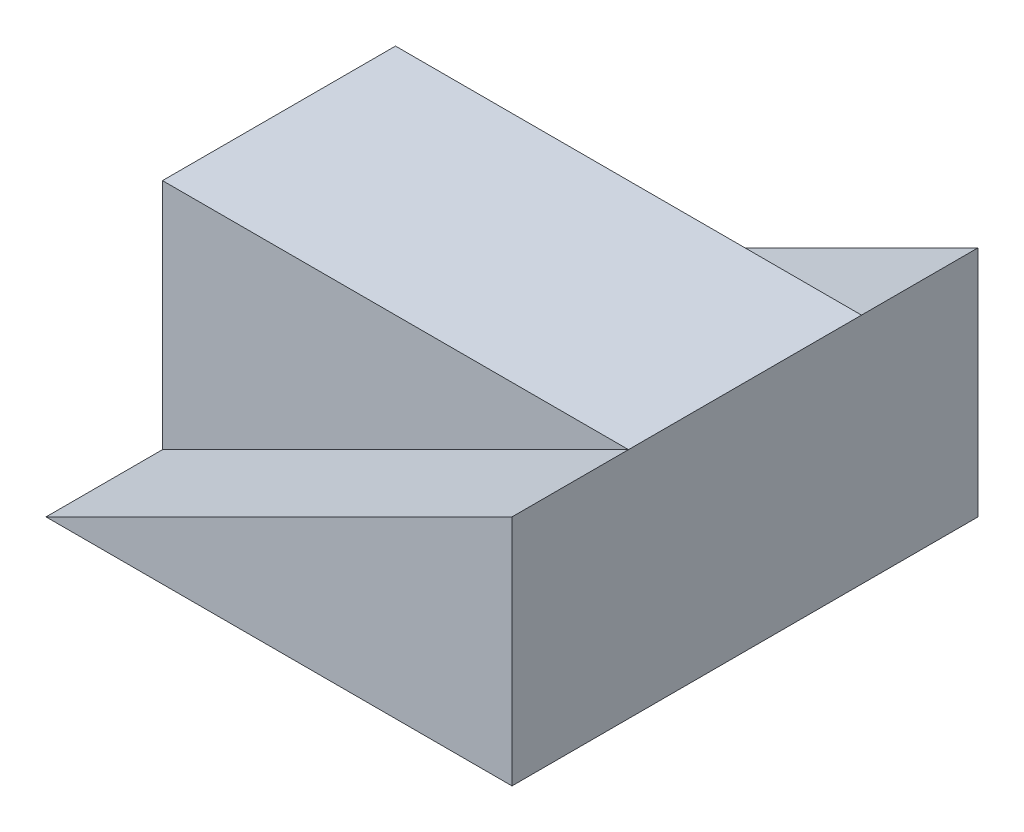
from build123d import *

# Parameters (mm, degrees)
SKETCH1_W      = 100
SKETCH1_H      = 50
EXTRUDE1_DEPTH = 25
EXTRUDE2_DEPTH = 50


with BuildPart() as part:
    # Sketch1 → Extrude1 (new, symmetric)
    with BuildSketch(Plane.XY):
        Rectangle(SKETCH1_W, SKETCH1_H)
    extrude(amount=EXTRUDE1_DEPTH, both=True)

    # Sketch5 → Extrude2 (add, symmetric)
    with BuildSketch(Plane.XY):
        Polygon((50, 25), (-50, -25), (50, -25), align=None)
    extrude(amount=EXTRUDE2_DEPTH, both=True)


solid = part.part
